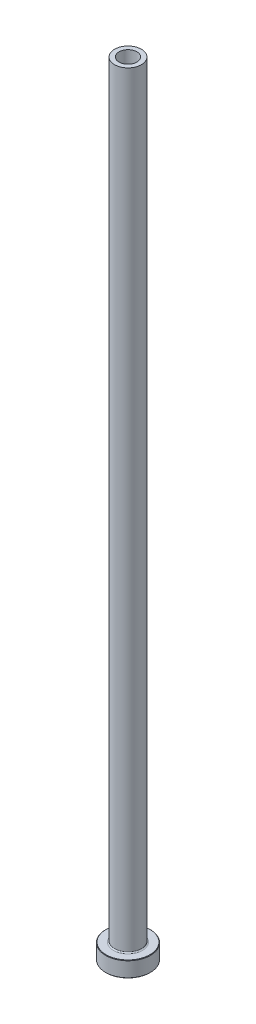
ISO-10303-21;
HEADER;
FILE_DESCRIPTION(('STEP AP214'),'2;1');
FILE_NAME('part.step','',(''),(''),'','','');
FILE_SCHEMA(('AUTOMOTIVE_DESIGN { 1 0 10303 214 1 1 1 1 }'));
ENDSEC;
DATA;
#1=APPLICATION_CONTEXT('core data for automotive mechanical design processes');
#2=APPLICATION_PROTOCOL_DEFINITION('international standard','automotive_design',2000,#1);
#3=PRODUCT_CONTEXT('',#1,'mechanical');
#4=PRODUCT('Part','Part','',(#3));
#5=PRODUCT_RELATED_PRODUCT_CATEGORY('part','',(#4));
#6=PRODUCT_DEFINITION_FORMATION('','',#4);
#7=PRODUCT_DEFINITION_CONTEXT('part definition',#1,'design');
#8=PRODUCT_DEFINITION('design','',#6,#7);
#9=PRODUCT_DEFINITION_SHAPE('','',#8);
#10=(LENGTH_UNIT() NAMED_UNIT(*) SI_UNIT(.MILLI.,.METRE.));
#11=(NAMED_UNIT(*) PLANE_ANGLE_UNIT() SI_UNIT($,.RADIAN.));
#12=(NAMED_UNIT(*) SI_UNIT($,.STERADIAN.) SOLID_ANGLE_UNIT());
#13=UNCERTAINTY_MEASURE_WITH_UNIT(LENGTH_MEASURE(1.E-05),#10,'distance_accuracy_value','');
#14=(GEOMETRIC_REPRESENTATION_CONTEXT(3) GLOBAL_UNCERTAINTY_ASSIGNED_CONTEXT((#13)) GLOBAL_UNIT_ASSIGNED_CONTEXT((#10,
#11,#12)) REPRESENTATION_CONTEXT('',''));
#15=CARTESIAN_POINT('',(0.,0.,0.));
#16=DIRECTION('',(0.,0.,1.));
#17=DIRECTION('',(1.,0.,0.));
#18=AXIS2_PLACEMENT_3D('',#15,#16,#17);
#19=CARTESIAN_POINT('',(0.,92.1876809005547,0.));
#20=DIRECTION('',(0.,1.,0.));
#21=DIRECTION('',(0.,0.,1.));
#22=AXIS2_PLACEMENT_3D('',#19,#20,#21);
#23=CYLINDRICAL_SURFACE('',#22,4.00000000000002);
#24=CARTESIAN_POINT('',(0.,350.,0.));
#25=DIRECTION('',(0.,1.,0.));
#26=DIRECTION('',(0.,0.,1.));
#27=AXIS2_PLACEMENT_3D('',#24,#25,#26);
#28=CIRCLE('',#27,4.00000000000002);
#29=CARTESIAN_POINT('',(0.,350.,4.00000000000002));
#30=VERTEX_POINT('',#29);
#31=EDGE_CURVE('E62',#30,#30,#28,.T.);
#32=ORIENTED_EDGE('',*,*,#31,.T.);
#33=EDGE_LOOP('',(#32));
#34=FACE_BOUND('',#33,.T.);
#35=CARTESIAN_POINT('',(0.,305.,0.));
#36=DIRECTION('',(0.,1.,0.));
#37=DIRECTION('',(0.,0.,1.));
#38=AXIS2_PLACEMENT_3D('',#35,#36,#37);
#39=CIRCLE('',#38,4.00000000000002);
#40=CARTESIAN_POINT('',(0.,305.,4.00000000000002));
#41=VERTEX_POINT('',#40);
#42=EDGE_CURVE('E71',#41,#41,#39,.T.);
#43=ORIENTED_EDGE('',*,*,#42,.F.);
#44=EDGE_LOOP('',(#43));
#45=FACE_BOUND('',#44,.T.);
#46=ADVANCED_FACE('F30',(#34,#45),#23,.F.);
#47=CARTESIAN_POINT('',(-4.00000000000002,350.,0.));
#48=DIRECTION('',(0.,1.,0.));
#49=DIRECTION('',(0.,0.,1.));
#50=AXIS2_PLACEMENT_3D('',#47,#48,#49);
#51=PLANE('',#50);
#52=CARTESIAN_POINT('',(0.,350.,0.));
#53=DIRECTION('',(0.,1.,0.));
#54=DIRECTION('',(0.,0.,1.));
#55=AXIS2_PLACEMENT_3D('',#52,#53,#54);
#56=CIRCLE('',#55,6.00000000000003);
#57=CARTESIAN_POINT('',(0.,350.,6.00000000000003));
#58=VERTEX_POINT('',#57);
#59=EDGE_CURVE('E65',#58,#58,#56,.T.);
#60=ORIENTED_EDGE('',*,*,#59,.T.);
#61=EDGE_LOOP('',(#60));
#62=FACE_BOUND('',#61,.T.);
#63=ORIENTED_EDGE('',*,*,#31,.F.);
#64=EDGE_LOOP('',(#63));
#65=FACE_BOUND('',#64,.T.);
#66=ADVANCED_FACE('F79',(#62,#65),#51,.T.);
#67=CARTESIAN_POINT('',(0.,92.1876809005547,0.));
#68=DIRECTION('',(0.,1.,0.));
#69=DIRECTION('',(0.,0.,1.));
#70=AXIS2_PLACEMENT_3D('',#67,#68,#69);
#71=CYLINDRICAL_SURFACE('',#70,6.00000000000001);
#72=CARTESIAN_POINT('',(0.,7.50000000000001,0.));
#73=DIRECTION('',(0.,1.,0.));
#74=DIRECTION('',(0.,0.,1.));
#75=AXIS2_PLACEMENT_3D('',#72,#73,#74);
#76=CIRCLE('',#75,6.00000000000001);
#77=CARTESIAN_POINT('',(0.,7.50000000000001,6.00000000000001));
#78=VERTEX_POINT('',#77);
#79=EDGE_CURVE('E59',#78,#78,#76,.T.);
#80=ORIENTED_EDGE('',*,*,#79,.T.);
#81=EDGE_LOOP('',(#80));
#82=FACE_BOUND('',#81,.T.);
#83=ORIENTED_EDGE('',*,*,#59,.F.);
#84=EDGE_LOOP('',(#83));
#85=FACE_BOUND('',#84,.T.);
#86=ADVANCED_FACE('F85',(#82,#85),#71,.T.);
#87=CARTESIAN_POINT('',(-5.99999999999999,7.,0.));
#88=DIRECTION('',(0.,1.,0.));
#89=DIRECTION('',(0.,0.,1.));
#90=AXIS2_PLACEMENT_3D('',#87,#88,#89);
#91=PLANE('',#90);
#92=CARTESIAN_POINT('',(0.,7.,0.));
#93=DIRECTION('',(0.,1.,0.));
#94=DIRECTION('',(0.,0.,1.));
#95=AXIS2_PLACEMENT_3D('',#92,#93,#94);
#96=CIRCLE('',#95,9.79999999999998);
#97=CARTESIAN_POINT('',(0.,7.,9.79999999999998));
#98=VERTEX_POINT('',#97);
#99=EDGE_CURVE('E53',#98,#98,#96,.T.);
#100=ORIENTED_EDGE('',*,*,#99,.T.);
#101=EDGE_LOOP('',(#100));
#102=FACE_BOUND('',#101,.T.);
#103=CARTESIAN_POINT('',(0.,7.,0.));
#104=DIRECTION('',(0.,1.,0.));
#105=DIRECTION('',(0.,0.,1.));
#106=AXIS2_PLACEMENT_3D('',#103,#104,#105);
#107=CIRCLE('',#106,6.50000000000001);
#108=CARTESIAN_POINT('',(0.,7.,6.50000000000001));
#109=VERTEX_POINT('',#108);
#110=EDGE_CURVE('E56',#109,#109,#107,.F.);
#111=ORIENTED_EDGE('',*,*,#110,.T.);
#112=EDGE_LOOP('',(#111));
#113=FACE_BOUND('',#112,.T.);
#114=ADVANCED_FACE('F111',(#102,#113),#91,.T.);
#115=CARTESIAN_POINT('',(0.,92.1876809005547,0.));
#116=DIRECTION('',(0.,1.,0.));
#117=DIRECTION('',(0.,0.,1.));
#118=AXIS2_PLACEMENT_3D('',#115,#116,#117);
#119=CYLINDRICAL_SURFACE('',#118,9.99999999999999);
#120=CARTESIAN_POINT('',(0.,6.79999999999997,0.));
#121=DIRECTION('',(0.,1.,0.));
#122=DIRECTION('',(0.,0.,1.));
#123=AXIS2_PLACEMENT_3D('',#120,#121,#122);
#124=CIRCLE('',#123,9.99999999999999);
#125=CARTESIAN_POINT('',(0.,6.79999999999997,9.99999999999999));
#126=VERTEX_POINT('',#125);
#127=EDGE_CURVE('E45',#126,#126,#124,.F.);
#128=ORIENTED_EDGE('',*,*,#127,.T.);
#129=EDGE_LOOP('',(#128));
#130=FACE_BOUND('',#129,.T.);
#131=CARTESIAN_POINT('',(0.,0.200000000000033,0.));
#132=DIRECTION('',(0.,-1.,0.));
#133=DIRECTION('',(0.,0.,-1.));
#134=AXIS2_PLACEMENT_3D('',#131,#132,#133);
#135=CIRCLE('',#134,9.99999999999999);
#136=CARTESIAN_POINT('',(0.,0.200000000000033,-9.99999999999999));
#137=VERTEX_POINT('',#136);
#138=EDGE_CURVE('E50',#137,#137,#135,.F.);
#139=ORIENTED_EDGE('',*,*,#138,.T.);
#140=EDGE_LOOP('',(#139));
#141=FACE_BOUND('',#140,.T.);
#142=ADVANCED_FACE('F108',(#130,#141),#119,.T.);
#143=CARTESIAN_POINT('',(-9.99999999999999,0.,0.));
#144=DIRECTION('',(0.,-1.,0.));
#145=DIRECTION('',(0.,0.,-1.));
#146=AXIS2_PLACEMENT_3D('',#143,#144,#145);
#147=PLANE('',#146);
#148=CARTESIAN_POINT('',(0.,0.,0.));
#149=DIRECTION('',(0.,-1.,0.));
#150=DIRECTION('',(0.,0.,-1.));
#151=AXIS2_PLACEMENT_3D('',#148,#149,#150);
#152=CIRCLE('',#151,4.75);
#153=CARTESIAN_POINT('',(0.,0.,-4.75));
#154=VERTEX_POINT('',#153);
#155=EDGE_CURVE('E37',#154,#154,#152,.F.);
#156=ORIENTED_EDGE('',*,*,#155,.T.);
#157=EDGE_LOOP('',(#156));
#158=FACE_BOUND('',#157,.T.);
#159=CARTESIAN_POINT('',(0.,0.,0.));
#160=DIRECTION('',(0.,-1.,0.));
#161=DIRECTION('',(0.,0.,-1.));
#162=AXIS2_PLACEMENT_3D('',#159,#160,#161);
#163=CIRCLE('',#162,9.79999999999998);
#164=CARTESIAN_POINT('',(0.,0.,-9.79999999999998));
#165=VERTEX_POINT('',#164);
#166=EDGE_CURVE('E41',#165,#165,#163,.T.);
#167=ORIENTED_EDGE('',*,*,#166,.T.);
#168=EDGE_LOOP('',(#167));
#169=FACE_BOUND('',#168,.T.);
#170=ADVANCED_FACE('F110',(#158,#169),#147,.T.);
#171=CARTESIAN_POINT('',(0.,92.1876809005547,0.));
#172=DIRECTION('',(0.,1.,0.));
#173=DIRECTION('',(0.,0.,1.));
#174=AXIS2_PLACEMENT_3D('',#171,#172,#173);
#175=CYLINDRICAL_SURFACE('',#174,4.25000000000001);
#176=CARTESIAN_POINT('',(0.,0.499999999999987,0.));
#177=DIRECTION('',(0.,-1.,0.));
#178=DIRECTION('',(0.,0.,-1.));
#179=AXIS2_PLACEMENT_3D('',#176,#177,#178);
#180=CIRCLE('',#179,4.25000000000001);
#181=CARTESIAN_POINT('',(0.,0.499999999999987,-4.25000000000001));
#182=VERTEX_POINT('',#181);
#183=EDGE_CURVE('E10',#182,#182,#180,.T.);
#184=ORIENTED_EDGE('',*,*,#183,.T.);
#185=EDGE_LOOP('',(#184));
#186=FACE_BOUND('',#185,.T.);
#187=CARTESIAN_POINT('',(0.,293.,0.));
#188=DIRECTION('',(0.,1.,0.));
#189=DIRECTION('',(0.,0.,1.));
#190=AXIS2_PLACEMENT_3D('',#187,#188,#189);
#191=CIRCLE('',#190,4.25000000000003);
#192=CARTESIAN_POINT('',(0.,293.,4.25000000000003));
#193=VERTEX_POINT('',#192);
#194=EDGE_CURVE('E68',#193,#193,#191,.T.);
#195=ORIENTED_EDGE('',*,*,#194,.T.);
#196=EDGE_LOOP('',(#195));
#197=FACE_BOUND('',#196,.T.);
#198=ADVANCED_FACE('F118',(#186,#197),#175,.F.);
#199=CARTESIAN_POINT('',(0.,293.,0.));
#200=DIRECTION('',(0.,-1.,0.));
#201=DIRECTION('',(0.,0.,-1.));
#202=AXIS2_PLACEMENT_3D('',#199,#200,#201);
#203=CONICAL_SURFACE('',#202,4.25000000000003,0.0208303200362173);
#204=ORIENTED_EDGE('',*,*,#42,.T.);
#205=EDGE_LOOP('',(#204));
#206=FACE_BOUND('',#205,.T.);
#207=ORIENTED_EDGE('',*,*,#194,.F.);
#208=EDGE_LOOP('',(#207));
#209=FACE_BOUND('',#208,.T.);
#210=ADVANCED_FACE('F75',(#206,#209),#203,.F.);
#211=CARTESIAN_POINT('',(0.,7.50000000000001,0.));
#212=DIRECTION('',(0.,1.,0.));
#213=DIRECTION('',(0.,0.,1.));
#214=AXIS2_PLACEMENT_3D('',#211,#212,#213);
#215=TOROIDAL_SURFACE('',#214,6.50000000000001,0.5);
#216=ORIENTED_EDGE('',*,*,#110,.F.);
#217=EDGE_LOOP('',(#216));
#218=FACE_BOUND('',#217,.T.);
#219=ORIENTED_EDGE('',*,*,#79,.F.);
#220=EDGE_LOOP('',(#219));
#221=FACE_BOUND('',#220,.T.);
#222=ADVANCED_FACE('F90',(#218,#221),#215,.F.);
#223=CARTESIAN_POINT('',(0.,7.00000000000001,0.));
#224=DIRECTION('',(0.,-1.,0.));
#225=DIRECTION('',(0.,0.,-1.));
#226=AXIS2_PLACEMENT_3D('',#223,#224,#225);
#227=CONICAL_SURFACE('',#226,9.79999999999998,0.785398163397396);
#228=ORIENTED_EDGE('',*,*,#127,.F.);
#229=EDGE_LOOP('',(#228));
#230=FACE_BOUND('',#229,.T.);
#231=ORIENTED_EDGE('',*,*,#99,.F.);
#232=EDGE_LOOP('',(#231));
#233=FACE_BOUND('',#232,.T.);
#234=ADVANCED_FACE('F93',(#230,#233),#227,.T.);
#235=CARTESIAN_POINT('',(0.,0.200000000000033,0.));
#236=DIRECTION('',(0.,1.,0.));
#237=DIRECTION('',(0.,0.,1.));
#238=AXIS2_PLACEMENT_3D('',#235,#236,#237);
#239=CONICAL_SURFACE('',#238,9.99999999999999,0.785398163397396);
#240=ORIENTED_EDGE('',*,*,#166,.F.);
#241=EDGE_LOOP('',(#240));
#242=FACE_BOUND('',#241,.T.);
#243=ORIENTED_EDGE('',*,*,#138,.F.);
#244=EDGE_LOOP('',(#243));
#245=FACE_BOUND('',#244,.T.);
#246=ADVANCED_FACE('F96',(#242,#245),#239,.T.);
#247=CARTESIAN_POINT('',(0.,0.,0.));
#248=DIRECTION('',(0.,-1.,0.));
#249=DIRECTION('',(0.,0.,-1.));
#250=AXIS2_PLACEMENT_3D('',#247,#248,#249);
#251=CONICAL_SURFACE('',#250,4.75,0.785398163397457);
#252=ORIENTED_EDGE('',*,*,#183,.F.);
#253=EDGE_LOOP('',(#252));
#254=FACE_BOUND('',#253,.T.);
#255=ORIENTED_EDGE('',*,*,#155,.F.);
#256=EDGE_LOOP('',(#255));
#257=FACE_BOUND('',#256,.T.);
#258=ADVANCED_FACE('F32',(#254,#257),#251,.F.);
#259=CLOSED_SHELL('',(#46,#66,#86,#114,#142,#170,#198,#210,#222,#234,#246,#258));
#260=MANIFOLD_SOLID_BREP('B2',#259);
#261=ADVANCED_BREP_SHAPE_REPRESENTATION('',(#18,#260),#14);
#262=SHAPE_DEFINITION_REPRESENTATION(#9,#261);
ENDSEC;
END-ISO-10303-21;
